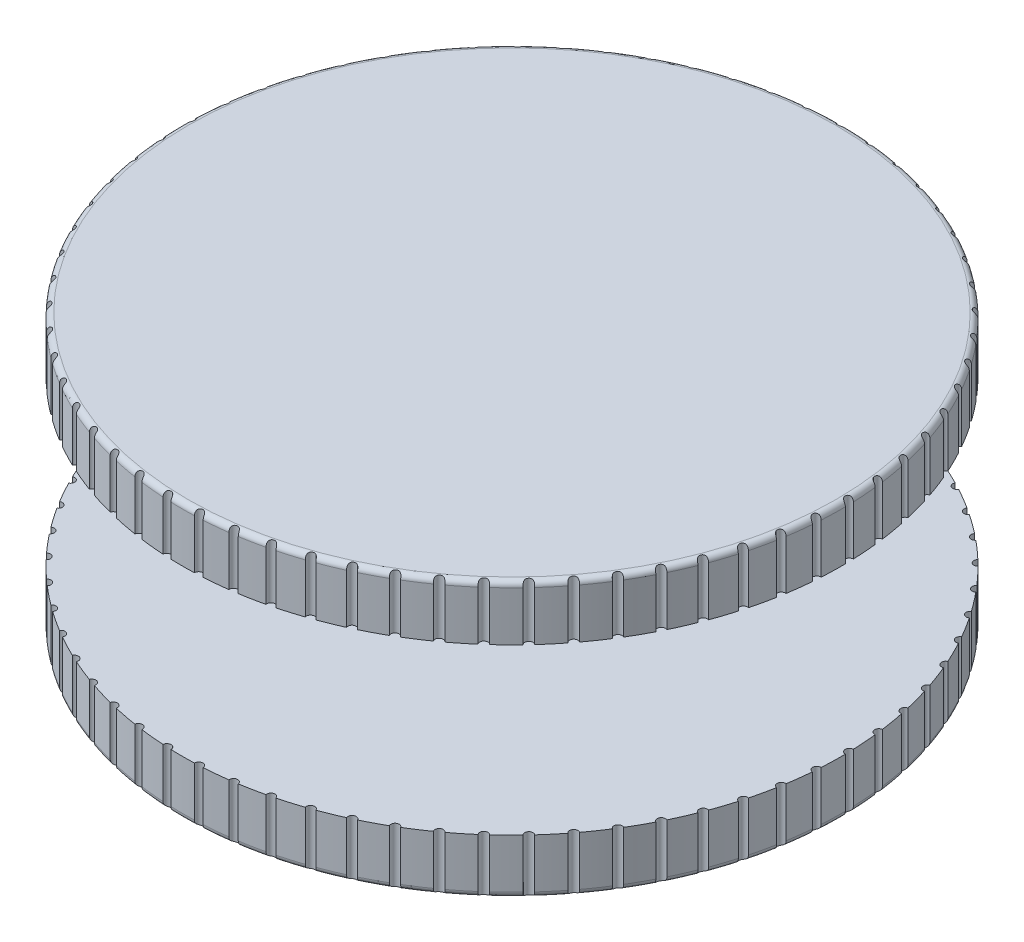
from build123d import *

# Parameters (mm, degrees)
FILLET1_R          = 0.1
SKETCH3_R          = 0.075
CUT_EXTRUDE3_DEPTH = 10.848857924


with BuildPart() as part:
    # Sketch1 → Revolve1 (revolve)
    with BuildSketch(Plane.XY, mode=Mode.PRIVATE) as revolve1_sk:
        Polygon((0, 0), (-1, 0), (-1, 1.5), (-6, 1.5), (-6, 2.5), (0, 2.5), align=None)
    revolve1 = revolve(revolve1_sk.sketch.rotate(Axis((0, 8.382180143, 0), (0, -1, 0)), 270), axis=Axis((0, 8.382180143, 0), (0, -1, 0)))

    # Mirror1: Revolve1 across plane
    add(revolve1.mirror(Plane(origin=(0, 0, 0), x_dir=(0, 0, 1), z_dir=(0, -1, 0))))

    # Fillet1
    fillet1_edges = [part.edges().sort_by_distance(p)[0] for p in [
        (0, -2.5, -6),
        (0, 2.5, -6),
    ]]
    fillet(fillet1_edges, radius=FILLET1_R)

    # Sketch3 → Cut-Extrude3 (cut, through all)
    with BuildSketch(Plane(origin=(0, 2.5, 0), x_dir=(1, 0, 0), z_dir=(0, 1, 0))):
        with Locations((0, 6)):
            Circle(SKETCH3_R)
        with Locations((0.579083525, 5.971989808)):
            Circle(SKETCH3_R)
        with Locations((1.152760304, 5.888220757)):
            Circle(SKETCH3_R)
        with Locations((1.71567407, 5.749474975)):
            Circle(SKETCH3_R)
        with Locations((2.26256905, 5.557047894)):
            Circle(SKETCH3_R)
        with Locations((2.788339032, 5.312736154)):
            Circle(SKETCH3_R)
        with Locations((3.288075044, 5.018820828)):
            Circle(SKETCH3_R)
        with Locations((3.757111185, 4.678046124)):
            Circle(SKETCH3_R)
        with Locations((4.191068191, 4.293593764)):
            Circle(SKETCH3_R)
        with Locations((4.585894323, 3.869053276)):
            Circle(SKETCH3_R)
        with Locations((4.937903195, 3.40838848)):
            Circle(SKETCH3_R)
        with Locations((5.243808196, 2.915900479)):
            Circle(SKETCH3_R)
        with Locations((5.500753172, 2.396187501)):
            Circle(SKETCH3_R)
        with Locations((5.706339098, 1.854101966)):
            Circle(SKETCH3_R)
        with Locations((5.858646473, 1.294705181)):
            Circle(SKETCH3_R)
        with Locations((5.956253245, 0.723220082)):
            Circle(SKETCH3_R)
        with Locations((5.998248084, 0.144982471)):
            Circle(SKETCH3_R)
        with Locations((5.984238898, -0.434608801)):
            Circle(SKETCH3_R)
        with Locations((5.914356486, -1.010142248)):
            Circle(SKETCH3_R)
        with Locations((5.78925332, -1.576244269)):
            Circle(SKETCH3_R)
        with Locations((5.610097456, -2.127629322)):
            Circle(SKETCH3_R)
        with Locations((5.378561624, -2.659149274)):
            Circle(SKETCH3_R)
        with Locations((5.096807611, -3.165841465)):
            Circle(SKETCH3_R)
        with Locations((4.767466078, -3.642975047)):
            Circle(SKETCH3_R)
        with Locations((4.393612, -4.086095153)):
            Circle(SKETCH3_R)
        with Locations((3.978735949, -4.491064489)):
            Circle(SKETCH3_R)
        with Locations((3.526711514, -4.854101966)):
            Circle(SKETCH3_R)
        with Locations((3.041759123, -5.171818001)):
            Circle(SKETCH3_R)
        with Locations((2.528406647, -5.441246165)):
            Circle(SKETCH3_R)
        with Locations((1.991447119, -5.65987088)):
            Circle(SKETCH3_R)
        with Locations((1.435893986, -5.825650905)):
            Circle(SKETCH3_R)
        with Locations((0.866934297, -5.937038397)):
            Circle(SKETCH3_R)
        with Locations((0.289880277, -5.992993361)):
            Circle(SKETCH3_R)
        with Locations((-0.289880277, -5.992993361)):
            Circle(SKETCH3_R)
        with Locations((-0.866934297, -5.937038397)):
            Circle(SKETCH3_R)
        with Locations((-1.435893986, -5.825650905)):
            Circle(SKETCH3_R)
        with Locations((-1.991447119, -5.65987088)):
            Circle(SKETCH3_R)
        with Locations((-2.528406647, -5.441246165)):
            Circle(SKETCH3_R)
        with Locations((-3.041759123, -5.171818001)):
            Circle(SKETCH3_R)
        with Locations((-3.526711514, -4.854101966)):
            Circle(SKETCH3_R)
        with Locations((-3.978735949, -4.491064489)):
            Circle(SKETCH3_R)
        with Locations((-4.393612, -4.086095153)):
            Circle(SKETCH3_R)
        with Locations((-4.767466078, -3.642975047)):
            Circle(SKETCH3_R)
        with Locations((-5.096807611, -3.165841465)):
            Circle(SKETCH3_R)
        with Locations((-5.378561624, -2.659149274)):
            Circle(SKETCH3_R)
        with Locations((-5.610097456, -2.127629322)):
            Circle(SKETCH3_R)
        with Locations((-5.78925332, -1.576244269)):
            Circle(SKETCH3_R)
        with Locations((-5.914356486, -1.010142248)):
            Circle(SKETCH3_R)
        with Locations((-5.984238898, -0.434608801)):
            Circle(SKETCH3_R)
        with Locations((-5.998248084, 0.144982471)):
            Circle(SKETCH3_R)
        with Locations((-5.956253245, 0.723220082)):
            Circle(SKETCH3_R)
        with Locations((-5.858646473, 1.294705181)):
            Circle(SKETCH3_R)
        with Locations((-5.706339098, 1.854101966)):
            Circle(SKETCH3_R)
        with Locations((-5.500753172, 2.396187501)):
            Circle(SKETCH3_R)
        with Locations((-5.243808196, 2.915900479)):
            Circle(SKETCH3_R)
        with Locations((-4.937903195, 3.40838848)):
            Circle(SKETCH3_R)
        with Locations((-4.585894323, 3.869053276)):
            Circle(SKETCH3_R)
        with Locations((-4.191068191, 4.293593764)):
            Circle(SKETCH3_R)
        with Locations((-3.757111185, 4.678046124)):
            Circle(SKETCH3_R)
        with Locations((-3.288075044, 5.018820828)):
            Circle(SKETCH3_R)
        with Locations((-2.788339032, 5.312736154)):
            Circle(SKETCH3_R)
        with Locations((-2.26256905, 5.557047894)):
            Circle(SKETCH3_R)
        with Locations((-1.71567407, 5.749474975)):
            Circle(SKETCH3_R)
        with Locations((-1.152760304, 5.888220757)):
            Circle(SKETCH3_R)
        with Locations((-0.579083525, 5.971989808)):
            Circle(SKETCH3_R)
    extrude(amount=-CUT_EXTRUDE3_DEPTH, mode=Mode.SUBTRACT)


solid = part.part
